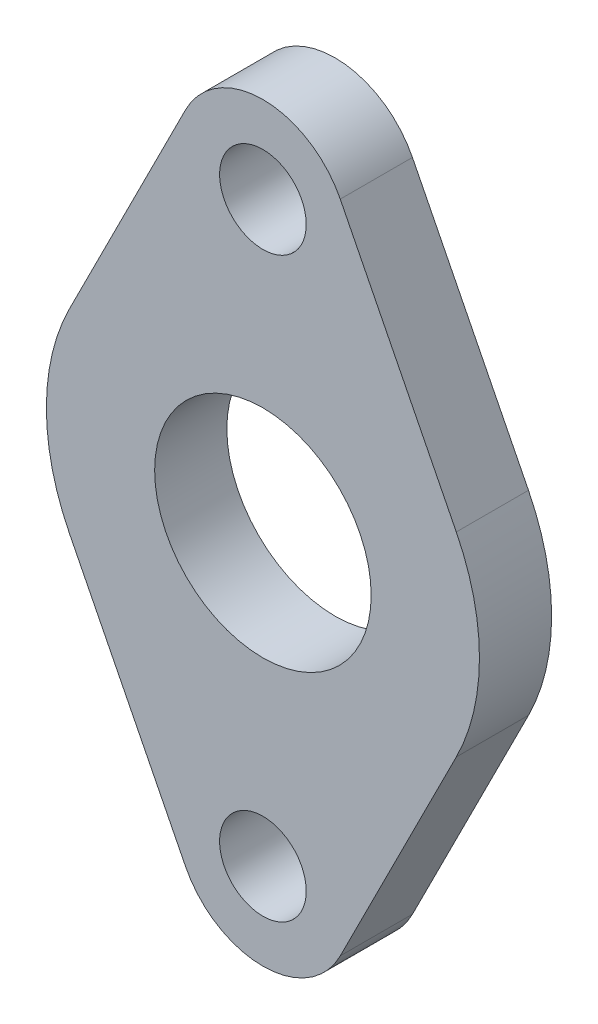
from build123d import *

# Parameters (mm, degrees)
SKETCH1_R           = 9.525
SKETCH1_R_2         = 3.81
BOSS_EXTRUDE1_DEPTH = 6.35


with BuildPart() as part:
    # Sketch1 → Boss-Extrude1 (new body)
    with BuildSketch(Plane.XY):
        with BuildLine():
            Line((-6.804877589, 28.829), (-17.012193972, 8.5725))
            ThreePointArc((-17.012193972, 8.5725), (-19.05, 0), (-17.012193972, -8.5725))
            Line((-17.012193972, -8.5725), (-6.804877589, -28.829))
            ThreePointArc((-6.804877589, -28.829), (0, -33.02), (6.804877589, -28.829))
            Line((6.804877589, -28.829), (17.012193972, -8.5725))
            ThreePointArc((17.012193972, -8.5725), (19.05, 0), (17.012193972, 8.5725))
            Line((17.012193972, 8.5725), (6.804877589, 28.829))
            ThreePointArc((6.804877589, 28.829), (0, 33.02), (-6.804877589, 28.829))
        make_face()
        Circle(SKETCH1_R, mode=Mode.SUBTRACT)
        with Locations((0, 25.4)):
            Circle(SKETCH1_R_2, mode=Mode.SUBTRACT)
        with Locations((0, -25.4)):
            Circle(SKETCH1_R_2, mode=Mode.SUBTRACT)
    extrude(amount=BOSS_EXTRUDE1_DEPTH)


solid = part.part
